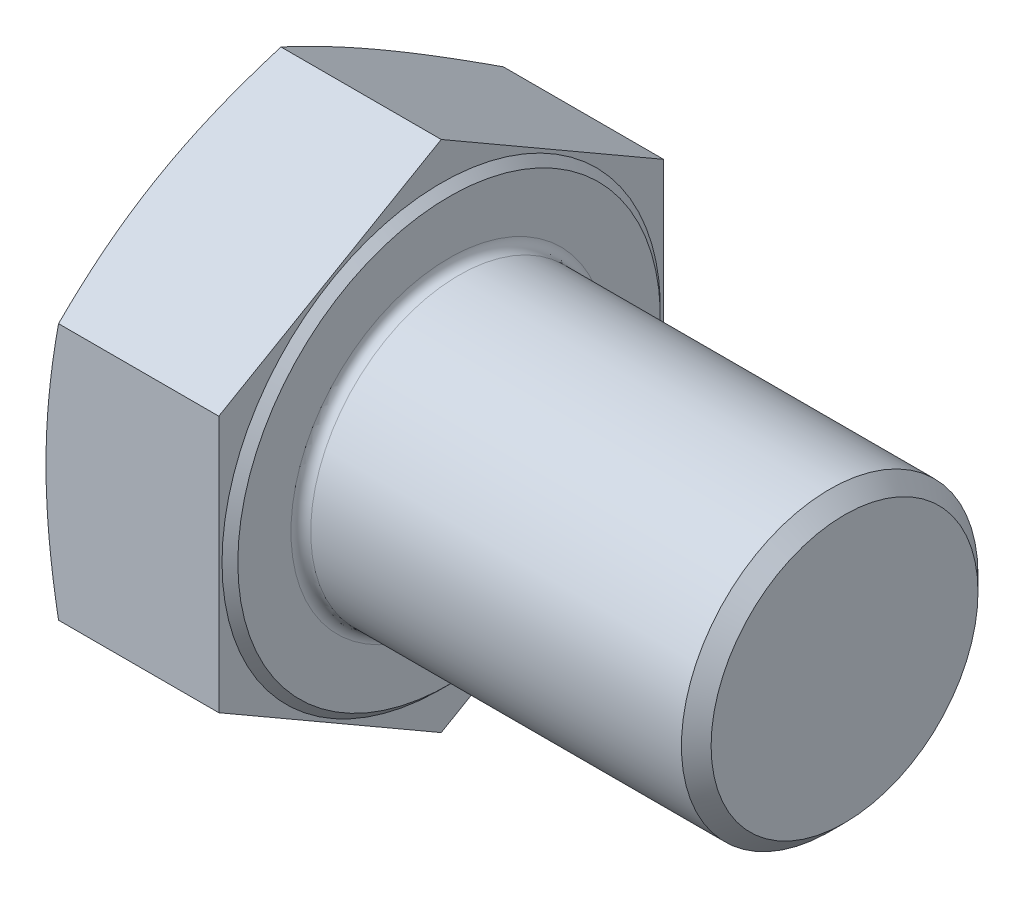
from build123d import *

# Parameters (mm, degrees)
BASEHEAD_DEPTH = 18.28
SKETCH5_R      = 15
BASEBODY_DEPTH = 40
CHAMFER1_SIZE  = 1.5
HEADFILLET_R   = 1


with BuildPart() as part:
    # Sketch2 → BaseHead (new body)
    with BuildSketch(Plane(origin=(0, 0, 0), x_dir=(0, 0, -1), z_dir=(1, 0, 0))):
        Polygon((22.5, -12.990381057), (22.5, 12.990381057), (0, 25.980762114), (-22.5, 12.990381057), (-22.5, -12.990381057), (0, -25.980762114), align=None)
    extrude(amount=BASEHEAD_DEPTH)

    # Sketch3 → BearingFace (revolve, cut)
    with BuildSketch(Plane.XY, mode=Mode.PRIVATE) as bearingface_sk:
        Polygon((18.28, 25.980762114), (18.28, 21.375), (17.48, 22.175), (17.48, 25.980762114), align=None)
    revolve(bearingface_sk.sketch.rotate(Axis((-0.957090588, 0, 0), (1, 0, 0)), 90), axis=Axis((-0.957090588, 0, 0), (1, 0, 0)), mode=Mode.SUBTRACT)

    # Sketch4 → HeadChamfer (revolve, cut)
    with BuildSketch(Plane.XY):
        Polygon((0, 25.980762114), (1.266893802, 25.980762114), (0, 22.5), align=None)
    revolve(axis=Axis((-0.493528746, 0, 0), (1, 0, 0)), mode=Mode.SUBTRACT)

    # Sketch5 → BaseBody (add)
    with BuildSketch(Plane(origin=(18.28, 0, 0), x_dir=(0, 0, -1), z_dir=(1, 0, 0))):
        Circle(SKETCH5_R)
    extrude(amount=BASEBODY_DEPTH)

    # Chamfer1
    chamfer1_edges = [part.edges().sort_by_distance(p)[0] for p in [
        (58.28, 0, 15),
    ]]
    chamfer(chamfer1_edges, length=CHAMFER1_SIZE)

    # HeadFillet
    headfillet_edges = [part.edges().sort_by_distance(p)[0] for p in [
        (18.28, 0, 15),
    ]]
    fillet(headfillet_edges, radius=HEADFILLET_R)


solid = part.part
